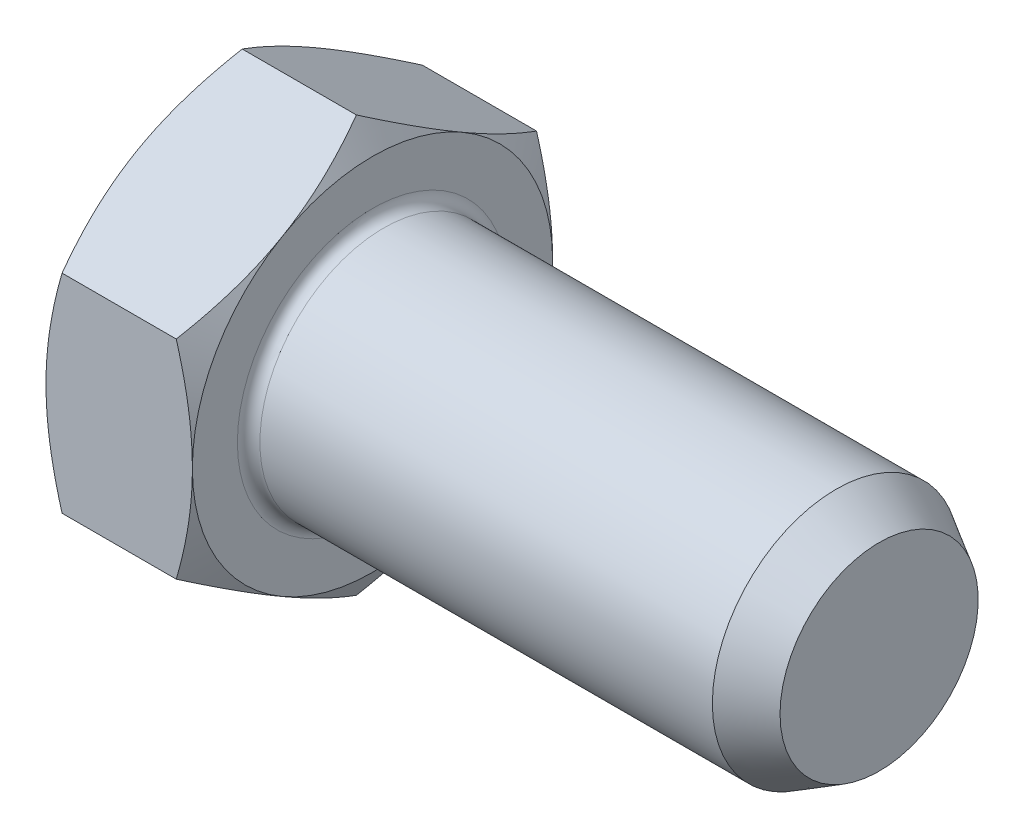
ISO-10303-21;
HEADER;
FILE_DESCRIPTION(('STEP AP214'),'2;1');
FILE_NAME('part.step','',(''),(''),'','','');
FILE_SCHEMA(('AUTOMOTIVE_DESIGN { 1 0 10303 214 1 1 1 1 }'));
ENDSEC;
DATA;
#1=APPLICATION_CONTEXT('core data for automotive mechanical design processes');
#2=APPLICATION_PROTOCOL_DEFINITION('international standard','automotive_design',2000,#1);
#3=PRODUCT_CONTEXT('',#1,'mechanical');
#4=PRODUCT('Part','Part','',(#3));
#5=PRODUCT_RELATED_PRODUCT_CATEGORY('part','',(#4));
#6=PRODUCT_DEFINITION_FORMATION('','',#4);
#7=PRODUCT_DEFINITION_CONTEXT('part definition',#1,'design');
#8=PRODUCT_DEFINITION('design','',#6,#7);
#9=PRODUCT_DEFINITION_SHAPE('','',#8);
#10=(LENGTH_UNIT() NAMED_UNIT(*) SI_UNIT(.MILLI.,.METRE.));
#11=(NAMED_UNIT(*) PLANE_ANGLE_UNIT() SI_UNIT($,.RADIAN.));
#12=(NAMED_UNIT(*) SI_UNIT($,.STERADIAN.) SOLID_ANGLE_UNIT());
#13=UNCERTAINTY_MEASURE_WITH_UNIT(LENGTH_MEASURE(1.E-05),#10,'distance_accuracy_value','');
#14=(GEOMETRIC_REPRESENTATION_CONTEXT(3) GLOBAL_UNCERTAINTY_ASSIGNED_CONTEXT((#13)) GLOBAL_UNIT_ASSIGNED_CONTEXT((#10,
#11,#12)) REPRESENTATION_CONTEXT('',''));
#15=CARTESIAN_POINT('',(0.,0.,0.));
#16=DIRECTION('',(0.,0.,1.));
#17=DIRECTION('',(1.,0.,0.));
#18=AXIS2_PLACEMENT_3D('',#15,#16,#17);
#19=CARTESIAN_POINT('',(0.,0.,0.));
#20=DIRECTION('',(-1.,0.,0.));
#21=DIRECTION('',(0.,0.,1.));
#22=AXIS2_PLACEMENT_3D('',#19,#20,#21);
#23=PLANE('',#22);
#24=CARTESIAN_POINT('',(0.,0.,0.));
#25=DIRECTION('',(-1.,0.,0.));
#26=DIRECTION('',(0.,0.,1.));
#27=AXIS2_PLACEMENT_3D('',#24,#25,#26);
#28=CIRCLE('',#27,1.6);
#29=CARTESIAN_POINT('',(0.,0.,1.6));
#30=VERTEX_POINT('',#29);
#31=CARTESIAN_POINT('',(0.,-1.3856406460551,0.799999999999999));
#32=VERTEX_POINT('',#31);
#33=EDGE_CURVE('E166',#30,#32,#28,.F.);
#34=ORIENTED_EDGE('',*,*,#33,.F.);
#35=CARTESIAN_POINT('',(0.,1.3856406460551,0.8));
#36=VERTEX_POINT('',#35);
#37=EDGE_CURVE('E131',#36,#30,#28,.F.);
#38=ORIENTED_EDGE('',*,*,#37,.F.);
#39=CARTESIAN_POINT('',(0.,1.3856406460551,-0.799999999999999));
#40=VERTEX_POINT('',#39);
#41=EDGE_CURVE('E164',#40,#36,#28,.F.);
#42=ORIENTED_EDGE('',*,*,#41,.F.);
#43=CARTESIAN_POINT('',(0.,0.,-1.6));
#44=VERTEX_POINT('',#43);
#45=EDGE_CURVE('E298',#44,#40,#28,.F.);
#46=ORIENTED_EDGE('',*,*,#45,.F.);
#47=CARTESIAN_POINT('',(0.,-1.3856406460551,-0.8));
#48=VERTEX_POINT('',#47);
#49=EDGE_CURVE('E302',#48,#44,#28,.F.);
#50=ORIENTED_EDGE('',*,*,#49,.F.);
#51=EDGE_CURVE('E309',#32,#48,#28,.F.);
#52=ORIENTED_EDGE('',*,*,#51,.F.);
#53=EDGE_LOOP('',(#34,#38,#42,#46,#50,#52));
#54=FACE_BOUND('',#53,.T.);
#55=CARTESIAN_POINT('',(0.,0.,0.));
#56=DIRECTION('',(-1.,0.,0.));
#57=DIRECTION('',(0.,0.,1.));
#58=AXIS2_PLACEMENT_3D('',#55,#56,#57);
#59=CIRCLE('',#58,1.28);
#60=CARTESIAN_POINT('',(0.,0.,1.28));
#61=VERTEX_POINT('',#60);
#62=EDGE_CURVE('E175',#61,#61,#59,.F.);
#63=ORIENTED_EDGE('',*,*,#62,.T.);
#64=EDGE_LOOP('',(#63));
#65=FACE_BOUND('',#64,.T.);
#66=ADVANCED_FACE('F35',(#54,#65),#23,.T.);
#67=CARTESIAN_POINT('',(1.3,1.4,0.));
#68=DIRECTION('',(1.,0.,0.));
#69=DIRECTION('',(0.,0.,-1.));
#70=AXIS2_PLACEMENT_3D('',#67,#68,#69);
#71=PLANE('',#70);
#72=CARTESIAN_POINT('',(1.3,0.,0.));
#73=DIRECTION('',(1.,0.,0.));
#74=DIRECTION('',(0.,0.,-1.));
#75=AXIS2_PLACEMENT_3D('',#72,#73,#74);
#76=CIRCLE('',#75,1.2);
#77=CARTESIAN_POINT('',(1.3,0.,-1.2));
#78=VERTEX_POINT('',#77);
#79=EDGE_CURVE('E11',#78,#78,#76,.F.);
#80=ORIENTED_EDGE('',*,*,#79,.T.);
#81=EDGE_LOOP('',(#80));
#82=FACE_BOUND('',#81,.T.);
#83=CARTESIAN_POINT('',(1.3,0.,0.));
#84=DIRECTION('',(1.,0.,0.));
#85=DIRECTION('',(0.,0.,-1.));
#86=AXIS2_PLACEMENT_3D('',#83,#84,#85);
#87=CIRCLE('',#86,1.6);
#88=CARTESIAN_POINT('',(1.3,-1.3856406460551,-0.8));
#89=VERTEX_POINT('',#88);
#90=CARTESIAN_POINT('',(1.3,0.,-1.6));
#91=VERTEX_POINT('',#90);
#92=EDGE_CURVE('E50',#89,#91,#87,.T.);
#93=ORIENTED_EDGE('',*,*,#92,.T.);
#94=CARTESIAN_POINT('',(1.3,1.3856406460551,-0.799999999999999));
#95=VERTEX_POINT('',#94);
#96=EDGE_CURVE('E58',#91,#95,#87,.T.);
#97=ORIENTED_EDGE('',*,*,#96,.T.);
#98=CARTESIAN_POINT('',(1.3,1.3856406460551,0.800000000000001));
#99=VERTEX_POINT('',#98);
#100=EDGE_CURVE('E344',#95,#99,#87,.T.);
#101=ORIENTED_EDGE('',*,*,#100,.T.);
#102=CARTESIAN_POINT('',(1.3,0.,1.6));
#103=VERTEX_POINT('',#102);
#104=EDGE_CURVE('E342',#99,#103,#87,.T.);
#105=ORIENTED_EDGE('',*,*,#104,.T.);
#106=CARTESIAN_POINT('',(1.3,-1.3856406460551,0.799999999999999));
#107=VERTEX_POINT('',#106);
#108=EDGE_CURVE('E339',#103,#107,#87,.T.);
#109=ORIENTED_EDGE('',*,*,#108,.T.);
#110=EDGE_CURVE('E332',#107,#89,#87,.T.);
#111=ORIENTED_EDGE('',*,*,#110,.T.);
#112=EDGE_LOOP('',(#93,#97,#101,#105,#109,#111));
#113=FACE_BOUND('',#112,.T.);
#114=ADVANCED_FACE('F340',(#82,#113),#71,.T.);
#115=CARTESIAN_POINT('',(13.1078858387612,0.,0.));
#116=DIRECTION('',(1.,0.,0.));
#117=DIRECTION('',(0.,0.,-1.));
#118=AXIS2_PLACEMENT_3D('',#115,#116,#117);
#119=CYLINDRICAL_SURFACE('',#118,1.1);
#120=CARTESIAN_POINT('',(1.4,0.,0.));
#121=DIRECTION('',(1.,0.,0.));
#122=DIRECTION('',(0.,0.,-1.));
#123=AXIS2_PLACEMENT_3D('',#120,#121,#122);
#124=CIRCLE('',#123,1.1);
#125=CARTESIAN_POINT('',(1.4,0.,-1.1));
#126=VERTEX_POINT('',#125);
#127=EDGE_CURVE('E43',#126,#126,#124,.T.);
#128=ORIENTED_EDGE('',*,*,#127,.T.);
#129=EDGE_LOOP('',(#128));
#130=FACE_BOUND('',#129,.T.);
#131=CARTESIAN_POINT('',(5.41894882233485,0.,0.));
#132=DIRECTION('',(1.,0.,0.));
#133=DIRECTION('',(0.,0.,-1.));
#134=AXIS2_PLACEMENT_3D('',#131,#132,#133);
#135=CIRCLE('',#134,1.1);
#136=CARTESIAN_POINT('',(5.41894882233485,0.,1.1));
#137=VERTEX_POINT('',#136);
#138=EDGE_CURVE('E354',#137,#137,#135,.F.);
#139=ORIENTED_EDGE('',*,*,#138,.T.);
#140=EDGE_LOOP('',(#139));
#141=FACE_BOUND('',#140,.T.);
#142=ADVANCED_FACE('F362',(#130,#141),#119,.T.);
#143=CARTESIAN_POINT('',(5.8,1.1,0.));
#144=DIRECTION('',(1.,0.,0.));
#145=DIRECTION('',(0.,0.,-1.));
#146=AXIS2_PLACEMENT_3D('',#143,#144,#145);
#147=PLANE('',#146);
#148=CARTESIAN_POINT('',(5.8,0.,0.));
#149=DIRECTION('',(1.,0.,0.));
#150=DIRECTION('',(0.,0.,-1.));
#151=AXIS2_PLACEMENT_3D('',#148,#149,#150);
#152=CIRCLE('',#151,0.879999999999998);
#153=CARTESIAN_POINT('',(5.8,0.,0.879999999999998));
#154=VERTEX_POINT('',#153);
#155=EDGE_CURVE('E352',#154,#154,#152,.T.);
#156=ORIENTED_EDGE('',*,*,#155,.T.);
#157=EDGE_LOOP('',(#156));
#158=FACE_BOUND('',#157,.T.);
#159=ADVANCED_FACE('F383',(#158),#147,.T.);
#160=CARTESIAN_POINT('',(0.65,0.,0.));
#161=DIRECTION('',(-1.,0.,0.));
#162=DIRECTION('',(0.,0.,1.));
#163=AXIS2_PLACEMENT_3D('',#160,#161,#162);
#164=CONICAL_SURFACE('',#163,2.72583302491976,1.04719755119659);
#165=CARTESIAN_POINT('',(1.15702709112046,-0.923644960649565,1.6002));
#166=CARTESIAN_POINT('',(1.18047613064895,-0.964240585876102,1.52988631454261));
#167=CARTESIAN_POINT('',(1.20180264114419,-1.00518662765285,1.45896568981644));
#168=CARTESIAN_POINT('',(1.23902934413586,-1.08778782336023,1.31589622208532));
#169=CARTESIAN_POINT('',(1.25491636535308,-1.12944444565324,1.24374483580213));
#170=CARTESIAN_POINT('',(1.27964828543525,-1.21224140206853,1.10033630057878));
#171=CARTESIAN_POINT('',(1.28865776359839,-1.25336899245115,1.02910122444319));
#172=CARTESIAN_POINT('',(1.299415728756,-1.33581782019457,0.886295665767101));
#173=CARTESIAN_POINT('',(1.30117312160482,-1.37713875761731,0.814725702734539));
#174=CARTESIAN_POINT('',(1.29752882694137,-1.45435771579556,0.680978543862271));
#175=CARTESIAN_POINT('',(1.29302194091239,-1.49026726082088,0.618781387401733));
#176=CARTESIAN_POINT('',(1.27873412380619,-1.5618523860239,0.494792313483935));
#177=CARTESIAN_POINT('',(1.26894830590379,-1.59752771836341,0.433000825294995));
#178=CARTESIAN_POINT('',(1.24448308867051,-1.66926059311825,0.30875584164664));
#179=CARTESIAN_POINT('',(1.22969992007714,-1.70530905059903,0.246318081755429));
#180=CARTESIAN_POINT('',(1.19614739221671,-1.77686812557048,0.122374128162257));
#181=CARTESIAN_POINT('',(1.17738592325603,-1.81237966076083,0.0608663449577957));
#182=CARTESIAN_POINT('',(1.15702709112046,-1.84763633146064,-0.000199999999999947));
#183=B_SPLINE_CURVE_WITH_KNOTS('',3,(#165,#166,#167,#168,#169,#170,#171,#172,#173,#174,#175,
#176,#177,#178,#179,#180,#181,#182),.UNSPECIFIED.,.F.,.F.,(4,2,2,2,2,2,2,2,4),(0.,
0.253628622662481,0.507867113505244,0.755812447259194,1.0034532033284,1.21912891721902,
1.43500463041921,1.65567058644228,1.87590291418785),.UNSPECIFIED.);
#184=CARTESIAN_POINT('',(1.15709376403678,-0.923760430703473,1.6));
#185=VERTEX_POINT('',#184);
#186=EDGE_CURVE('E159',#185,#107,#183,.T.);
#187=ORIENTED_EDGE('',*,*,#186,.T.);
#188=ORIENTED_EDGE('',*,*,#108,.F.);
#189=CARTESIAN_POINT('',(0.499873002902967,-2.52098464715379,1.6));
#190=CARTESIAN_POINT('',(0.534095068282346,-2.45076148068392,1.6));
#191=CARTESIAN_POINT('',(0.568000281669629,-2.38038131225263,1.6));
#192=CARTESIAN_POINT('',(0.634999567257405,-2.23922362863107,1.6));
#193=CARTESIAN_POINT('',(0.668093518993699,-2.16844605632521,1.6));
#194=CARTESIAN_POINT('',(0.733450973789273,-2.02606417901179,1.6));
#195=CARTESIAN_POINT('',(0.765709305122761,-1.95445749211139,1.6));
#196=CARTESIAN_POINT('',(0.828957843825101,-1.8106883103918,1.6));
#197=CARTESIAN_POINT('',(0.859948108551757,-1.73852584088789,1.6));
#198=CARTESIAN_POINT('',(0.921362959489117,-1.59104276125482,1.6));
#199=CARTESIAN_POINT('',(0.951731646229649,-1.51569874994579,1.6));
#200=CARTESIAN_POINT('',(1.01025914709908,-1.36415873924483,1.6));
#201=CARTESIAN_POINT('',(1.03841815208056,-1.28796281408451,1.6));
#202=CARTESIAN_POINT('',(1.09182525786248,-1.13470603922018,1.6));
#203=CARTESIAN_POINT('',(1.11707865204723,-1.05764705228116,1.6));
#204=CARTESIAN_POINT('',(1.16388736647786,-0.90242428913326,1.6));
#205=CARTESIAN_POINT('',(1.18544381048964,-0.824260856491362,1.6));
#206=CARTESIAN_POINT('',(1.22373292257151,-0.667228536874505,1.6));
#207=CARTESIAN_POINT('',(1.24049328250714,-0.588366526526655,1.6));
#208=CARTESIAN_POINT('',(1.26827361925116,-0.429622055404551,1.6));
#209=CARTESIAN_POINT('',(1.27929420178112,-0.349739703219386,1.6));
#210=CARTESIAN_POINT('',(1.2945707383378,-0.190409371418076,1.6));
#211=CARTESIAN_POINT('',(1.29891670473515,-0.110970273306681,1.6));
#212=CARTESIAN_POINT('',(1.30072544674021,0.0479847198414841,1.6));
#213=CARTESIAN_POINT('',(1.29818818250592,0.127500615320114,1.6));
#214=CARTESIAN_POINT('',(1.28423345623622,0.315948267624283,1.6));
#215=CARTESIAN_POINT('',(1.2698270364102,0.42466064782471,1.6));
#216=CARTESIAN_POINT('',(1.23056818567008,0.640184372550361,1.6));
#217=CARTESIAN_POINT('',(1.20570615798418,0.746993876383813,1.6));
#218=CARTESIAN_POINT('',(1.14763012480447,0.960879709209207,1.6));
#219=CARTESIAN_POINT('',(1.11423830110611,1.06790639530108,1.6));
#220=CARTESIAN_POINT('',(1.04181251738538,1.2799660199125,1.6));
#221=CARTESIAN_POINT('',(1.0027798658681,1.38499941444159,1.6));
#222=CARTESIAN_POINT('',(0.930792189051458,1.56799469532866,1.6));
#223=CARTESIAN_POINT('',(0.898685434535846,1.64629502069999,1.6));
#224=CARTESIAN_POINT('',(0.832721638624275,1.80215714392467,1.6));
#225=CARTESIAN_POINT('',(0.798864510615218,1.8797189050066,1.6));
#226=CARTESIAN_POINT('',(0.695256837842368,2.11154275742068,1.6));
#227=CARTESIAN_POINT('',(0.623487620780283,2.26490000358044,1.6));
#228=CARTESIAN_POINT('',(0.476501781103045,2.57016984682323,1.6));
#229=CARTESIAN_POINT('',(0.401280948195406,2.72208039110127,1.6));
#230=CARTESIAN_POINT('',(0.248594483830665,3.02477374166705,1.6));
#231=CARTESIAN_POINT('',(0.171128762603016,3.17555650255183,1.6));
#232=CARTESIAN_POINT('',(0.021984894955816,3.46221292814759,1.6));
#233=CARTESIAN_POINT('',(-0.0495548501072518,3.59815887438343,1.6));
#234=CARTESIAN_POINT('',(-0.1935806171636,3.86955633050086,1.6));
#235=CARTESIAN_POINT('',(-0.266066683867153,4.00500781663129,1.6));
#236=CARTESIAN_POINT('',(-0.411533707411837,4.27512524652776,1.6));
#237=CARTESIAN_POINT('',(-0.484512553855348,4.40979232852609,1.6));
#238=CARTESIAN_POINT('',(-0.631022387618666,4.67881425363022,1.6));
#239=CARTESIAN_POINT('',(-0.704553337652,4.81316911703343,1.6));
#240=CARTESIAN_POINT('',(-0.778287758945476,4.94741144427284,1.6));
#241=B_SPLINE_CURVE_WITH_KNOTS('',3,(#189,#190,#191,#192,#193,#194,#195,#196,#197,#198,#199,
#200,#201,#202,#203,#204,#205,#206,#207,#208,#209,#210,#211,#212,#213,#214,#215,#216,#217,#218,
#219,#220,#221,#222,#223,#224,#225,#226,#227,#228,#229,#230,#231,#232,#233,#234,#235,#236,#237,
#238,#239,#240),.UNSPECIFIED.,.F.,.F.,(4,2,2,2,2,2,2,2,2,2,2,2,2,2,2,2,2,2,2,2,2,2,2,2,2,4),(0.,
0.234357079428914,0.468748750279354,0.704350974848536,0.939942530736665,1.18361811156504,
1.42727262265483,1.67047597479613,1.91360526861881,2.15530105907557,2.39697133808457,
2.63535296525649,2.87373597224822,3.20204898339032,3.53066399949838,3.86678588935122,
4.2028299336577,4.45668877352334,4.71056018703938,5.21844347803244,5.72696367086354,
6.23550422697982,6.69636122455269,7.15724007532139,7.61674952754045,8.0762282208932),.UNSPECIFIED.);
#242=EDGE_CURVE('E167',#103,#185,#241,.F.);
#243=ORIENTED_EDGE('',*,*,#242,.T.);
#244=EDGE_LOOP('',(#187,#188,#243));
#245=FACE_BOUND('',#244,.T.);
#246=ADVANCED_FACE('F385',(#245),#164,.T.);
#247=CARTESIAN_POINT('',(1.15702709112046,1.84763633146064,-0.0001999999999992));
#248=CARTESIAN_POINT('',(1.18047613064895,1.8070407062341,0.0701136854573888));
#249=CARTESIAN_POINT('',(1.20180264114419,1.76609466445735,0.14103431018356));
#250=CARTESIAN_POINT('',(1.23902934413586,1.68349346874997,0.284103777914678));
#251=CARTESIAN_POINT('',(1.25491636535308,1.64183684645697,0.356255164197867));
#252=CARTESIAN_POINT('',(1.27964828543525,1.55903989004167,0.499663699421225));
#253=CARTESIAN_POINT('',(1.28865776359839,1.51791229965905,0.570898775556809));
#254=CARTESIAN_POINT('',(1.299415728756,1.43546347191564,0.713704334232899));
#255=CARTESIAN_POINT('',(1.30117312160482,1.39414253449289,0.785274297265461));
#256=CARTESIAN_POINT('',(1.29752882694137,1.31692357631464,0.919021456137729));
#257=CARTESIAN_POINT('',(1.29302194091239,1.28101403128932,0.981218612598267));
#258=CARTESIAN_POINT('',(1.27873412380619,1.20942890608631,1.10520768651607));
#259=CARTESIAN_POINT('',(1.26894830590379,1.1737535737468,1.16699917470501));
#260=CARTESIAN_POINT('',(1.24448308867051,1.10202069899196,1.29124415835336));
#261=CARTESIAN_POINT('',(1.22969992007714,1.06597224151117,1.35368191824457));
#262=CARTESIAN_POINT('',(1.19614739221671,0.994413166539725,1.47762587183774));
#263=CARTESIAN_POINT('',(1.17738592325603,0.958901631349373,1.5391336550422));
#264=CARTESIAN_POINT('',(1.15702709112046,0.923644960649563,1.6002));
#265=B_SPLINE_CURVE_WITH_KNOTS('',3,(#247,#248,#249,#250,#251,#252,#253,#254,#255,#256,#257,
#258,#259,#260,#261,#262,#263,#264),.UNSPECIFIED.,.F.,.F.,(4,2,2,2,2,2,2,2,4),(0.,
0.253628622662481,0.507867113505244,0.755812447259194,1.0034532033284,1.21912891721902,
1.43500463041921,1.65567058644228,1.87590291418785),.UNSPECIFIED.);
#266=CARTESIAN_POINT('',(1.15709376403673,0.923760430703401,1.6));
#267=VERTEX_POINT('',#266);
#268=EDGE_CURVE('E317',#99,#267,#265,.T.);
#269=ORIENTED_EDGE('',*,*,#268,.T.);
#270=EDGE_CURVE('E152',#267,#103,#241,.F.);
#271=ORIENTED_EDGE('',*,*,#270,.T.);
#272=ORIENTED_EDGE('',*,*,#104,.F.);
#273=EDGE_LOOP('',(#269,#271,#272));
#274=FACE_BOUND('',#273,.T.);
#275=ADVANCED_FACE('F177',(#274),#164,.T.);
#276=CARTESIAN_POINT('',(1.15702709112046,0.923644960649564,-1.6002));
#277=CARTESIAN_POINT('',(1.18047613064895,0.964240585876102,-1.52988631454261));
#278=CARTESIAN_POINT('',(1.20180264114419,1.00518662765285,-1.45896568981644));
#279=CARTESIAN_POINT('',(1.23902934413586,1.08778782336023,-1.31589622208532));
#280=CARTESIAN_POINT('',(1.25491636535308,1.12944444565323,-1.24374483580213));
#281=CARTESIAN_POINT('',(1.27964828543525,1.21224140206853,-1.10033630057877));
#282=CARTESIAN_POINT('',(1.28865776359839,1.25336899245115,-1.02910122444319));
#283=CARTESIAN_POINT('',(1.299415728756,1.33581782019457,-0.886295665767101));
#284=CARTESIAN_POINT('',(1.30117312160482,1.37713875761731,-0.814725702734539));
#285=CARTESIAN_POINT('',(1.29752882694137,1.45435771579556,-0.680978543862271));
#286=CARTESIAN_POINT('',(1.29302194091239,1.49026726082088,-0.618781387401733));
#287=CARTESIAN_POINT('',(1.27873412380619,1.5618523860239,-0.494792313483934));
#288=CARTESIAN_POINT('',(1.26894830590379,1.59752771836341,-0.433000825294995));
#289=CARTESIAN_POINT('',(1.24448308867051,1.66926059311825,-0.30875584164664));
#290=CARTESIAN_POINT('',(1.22969992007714,1.70530905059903,-0.246318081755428));
#291=CARTESIAN_POINT('',(1.19614739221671,1.77686812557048,-0.122374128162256));
#292=CARTESIAN_POINT('',(1.17738592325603,1.81237966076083,-0.0608663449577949));
#293=CARTESIAN_POINT('',(1.15702709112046,1.84763633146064,0.000200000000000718));
#294=B_SPLINE_CURVE_WITH_KNOTS('',3,(#276,#277,#278,#279,#280,#281,#282,#283,#284,#285,#286,
#287,#288,#289,#290,#291,#292,#293),.UNSPECIFIED.,.F.,.F.,(4,2,2,2,2,2,2,2,4),(0.,
0.253628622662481,0.507867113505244,0.755812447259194,1.0034532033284,1.21912891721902,
1.43500463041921,1.65567058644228,1.87590291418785),.UNSPECIFIED.);
#295=CARTESIAN_POINT('',(1.15709376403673,1.8475208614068,0.));
#296=VERTEX_POINT('',#295);
#297=EDGE_CURVE('E261',#95,#296,#294,.T.);
#298=ORIENTED_EDGE('',*,*,#297,.T.);
#299=EDGE_CURVE('E321',#296,#99,#265,.T.);
#300=ORIENTED_EDGE('',*,*,#299,.T.);
#301=ORIENTED_EDGE('',*,*,#100,.F.);
#302=EDGE_LOOP('',(#298,#300,#301));
#303=FACE_BOUND('',#302,.T.);
#304=ADVANCED_FACE('F350',(#303),#164,.T.);
#305=CARTESIAN_POINT('',(0.499873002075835,-2.5209846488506,-1.6));
#306=CARTESIAN_POINT('',(0.53409506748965,-2.45076148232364,-1.6));
#307=CARTESIAN_POINT('',(0.568000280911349,-2.38038131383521,-1.6));
#308=CARTESIAN_POINT('',(0.634999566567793,-2.23922363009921,-1.6));
#309=CARTESIAN_POINT('',(0.668093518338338,-2.16844605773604,-1.6));
#310=CARTESIAN_POINT('',(0.733450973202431,-2.02606418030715,-1.6));
#311=CARTESIAN_POINT('',(0.765709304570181,-1.95445749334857,-1.6));
#312=CARTESIAN_POINT('',(0.828957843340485,-1.81068831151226,-1.6));
#313=CARTESIAN_POINT('',(0.859948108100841,-1.73852584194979,-1.6));
#314=CARTESIAN_POINT('',(0.921362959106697,-1.59104276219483,-1.6));
#315=CARTESIAN_POINT('',(0.951731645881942,-1.51569875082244,-1.6));
#316=CARTESIAN_POINT('',(1.01025914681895,-1.36415873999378,-1.6));
#317=CARTESIAN_POINT('',(1.0384181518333,-1.28796281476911,-1.6));
#318=CARTESIAN_POINT('',(1.09182525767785,-1.1347060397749,-1.6));
#319=CARTESIAN_POINT('',(1.11707865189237,-1.05764705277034,-1.6));
#320=CARTESIAN_POINT('',(1.16388736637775,-0.902424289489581,-1.6));
#321=CARTESIAN_POINT('',(1.1854438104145,-0.824260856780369,-1.6));
#322=CARTESIAN_POINT('',(1.22373292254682,-0.667228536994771,-1.6));
#323=CARTESIAN_POINT('',(1.24049328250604,-0.588366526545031,-1.6));
#324=CARTESIAN_POINT('',(1.26827361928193,-0.429622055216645,-1.6));
#325=CARTESIAN_POINT('',(1.27929420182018,-0.349739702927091,-1.6));
#326=CARTESIAN_POINT('',(1.29457073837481,-0.190409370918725,-1.6));
#327=CARTESIAN_POINT('',(1.29891670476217,-0.110970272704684,-1.6));
#328=CARTESIAN_POINT('',(1.30072544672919,0.0479847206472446,-1.6));
#329=CARTESIAN_POINT('',(1.29818818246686,0.127500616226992,-1.6));
#330=CARTESIAN_POINT('',(1.28423345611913,0.315948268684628,-1.6));
#331=CARTESIAN_POINT('',(1.26982703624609,0.424660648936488,-1.6));
#332=CARTESIAN_POINT('',(1.23056818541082,0.640184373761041,-1.6));
#333=CARTESIAN_POINT('',(1.20570615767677,0.746993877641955,-1.6));
#334=CARTESIAN_POINT('',(1.14763012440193,0.960879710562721,-1.6));
#335=CARTESIAN_POINT('',(1.11423830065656,1.06790639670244,-1.6));
#336=CARTESIAN_POINT('',(1.0418125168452,1.27996602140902,-1.6));
#337=CARTESIAN_POINT('',(1.0027798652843,1.38499941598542,-1.6));
#338=CARTESIAN_POINT('',(0.930792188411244,1.56799469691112,-1.6));
#339=CARTESIAN_POINT('',(0.898685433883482,1.64629502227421,-1.6));
#340=CARTESIAN_POINT('',(0.832721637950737,1.80215714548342,-1.6));
#341=CARTESIAN_POINT('',(0.798864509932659,1.87971890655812,-1.6));
#342=CARTESIAN_POINT('',(0.695256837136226,2.11154275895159,-1.6));
#343=CARTESIAN_POINT('',(0.623487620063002,2.26490000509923,-1.6));
#344=CARTESIAN_POINT('',(0.476501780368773,2.57016984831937,-1.6));
#345=CARTESIAN_POINT('',(0.401280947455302,2.7220803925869,-1.6));
#346=CARTESIAN_POINT('',(0.248594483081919,3.02477374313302,-1.6));
#347=CARTESIAN_POINT('',(0.171128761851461,3.17555650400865,-1.6));
#348=CARTESIAN_POINT('',(0.0219848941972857,3.46221292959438,-1.6));
#349=CARTESIAN_POINT('',(-0.0495548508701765,3.59815887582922,-1.6));
#350=CARTESIAN_POINT('',(-0.193580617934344,3.86955633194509,-1.6));
#351=CARTESIAN_POINT('',(-0.266066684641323,4.00500781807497,-1.6));
#352=CARTESIAN_POINT('',(-0.411533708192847,4.2751252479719,-1.6));
#353=CARTESIAN_POINT('',(-0.48451255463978,4.40979232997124,-1.6));
#354=CARTESIAN_POINT('',(-0.631022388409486,4.67881425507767,-1.6));
#355=CARTESIAN_POINT('',(-0.704553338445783,4.81316911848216,-1.6));
#356=CARTESIAN_POINT('',(-0.778287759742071,4.94741144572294,-1.6));
#357=B_SPLINE_CURVE_WITH_KNOTS('',3,(#305,#306,#307,#308,#309,#310,#311,#312,#313,#314,#315,
#316,#317,#318,#319,#320,#321,#322,#323,#324,#325,#326,#327,#328,#329,#330,#331,#332,#333,#334,
#335,#336,#337,#338,#339,#340,#341,#342,#343,#344,#345,#346,#347,#348,#349,#350,#351,#352,#353,
#354,#355,#356),.UNSPECIFIED.,.F.,.F.,(4,2,2,2,2,2,2,2,2,2,2,2,2,2,2,2,2,2,2,2,2,2,2,2,2,4),(0.,
0.234357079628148,0.468748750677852,0.704350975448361,0.939942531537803,1.1836181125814,
1.42727262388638,1.67047597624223,1.9136052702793,2.1553010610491,2.3969713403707,
2.63535296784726,2.87373597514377,3.20204898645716,3.53066400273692,3.86678589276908,
4.20282993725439,4.45668877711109,4.71056019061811,5.21844348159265,5.7269636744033,
6.23550423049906,6.69636122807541,7.15724007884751,7.61674953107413,8.07622822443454),.UNSPECIFIED.);
#358=CARTESIAN_POINT('',(1.15709376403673,0.923760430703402,-1.6));
#359=VERTEX_POINT('',#358);
#360=EDGE_CURVE('E252',#91,#359,#357,.T.);
#361=ORIENTED_EDGE('',*,*,#360,.T.);
#362=EDGE_CURVE('E260',#359,#95,#294,.T.);
#363=ORIENTED_EDGE('',*,*,#362,.T.);
#364=ORIENTED_EDGE('',*,*,#96,.F.);
#365=EDGE_LOOP('',(#361,#363,#364));
#366=FACE_BOUND('',#365,.T.);
#367=ADVANCED_FACE('F397',(#366),#164,.T.);
#368=CARTESIAN_POINT('',(1.15702709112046,-1.84763633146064,0.0002));
#369=CARTESIAN_POINT('',(1.18047613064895,-1.8070407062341,-0.0701136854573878));
#370=CARTESIAN_POINT('',(1.20180264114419,-1.76609466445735,-0.141034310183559));
#371=CARTESIAN_POINT('',(1.23902934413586,-1.68349346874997,-0.284103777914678));
#372=CARTESIAN_POINT('',(1.25491636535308,-1.64183684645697,-0.356255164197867));
#373=CARTESIAN_POINT('',(1.27964828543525,-1.55903989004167,-0.499663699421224));
#374=CARTESIAN_POINT('',(1.28865776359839,-1.51791229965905,-0.570898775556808));
#375=CARTESIAN_POINT('',(1.299415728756,-1.43546347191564,-0.713704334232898));
#376=CARTESIAN_POINT('',(1.30117312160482,-1.39414253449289,-0.78527429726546));
#377=CARTESIAN_POINT('',(1.29752882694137,-1.31692357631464,-0.919021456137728));
#378=CARTESIAN_POINT('',(1.29302194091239,-1.28101403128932,-0.981218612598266));
#379=CARTESIAN_POINT('',(1.27873412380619,-1.20942890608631,-1.10520768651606));
#380=CARTESIAN_POINT('',(1.26894830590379,-1.1737535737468,-1.166999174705));
#381=CARTESIAN_POINT('',(1.24448308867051,-1.10202069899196,-1.29124415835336));
#382=CARTESIAN_POINT('',(1.22969992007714,-1.06597224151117,-1.35368191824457));
#383=CARTESIAN_POINT('',(1.19614739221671,-0.994413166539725,-1.47762587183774));
#384=CARTESIAN_POINT('',(1.17738592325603,-0.958901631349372,-1.5391336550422));
#385=CARTESIAN_POINT('',(1.15702709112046,-0.923644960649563,-1.6002));
#386=B_SPLINE_CURVE_WITH_KNOTS('',3,(#368,#369,#370,#371,#372,#373,#374,#375,#376,#377,#378,
#379,#380,#381,#382,#383,#384,#385),.UNSPECIFIED.,.F.,.F.,(4,2,2,2,2,2,2,2,4),(0.,
0.253628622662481,0.507867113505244,0.755812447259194,1.0034532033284,1.21912891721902,
1.43500463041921,1.65567058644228,1.87590291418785),.UNSPECIFIED.);
#387=CARTESIAN_POINT('',(1.15709376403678,-0.923760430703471,-1.6));
#388=VERTEX_POINT('',#387);
#389=EDGE_CURVE('E266',#89,#388,#386,.T.);
#390=ORIENTED_EDGE('',*,*,#389,.T.);
#391=EDGE_CURVE('E259',#388,#91,#357,.T.);
#392=ORIENTED_EDGE('',*,*,#391,.T.);
#393=ORIENTED_EDGE('',*,*,#92,.F.);
#394=EDGE_LOOP('',(#390,#392,#393));
#395=FACE_BOUND('',#394,.T.);
#396=ADVANCED_FACE('F393',(#395),#164,.T.);
#397=CARTESIAN_POINT('',(1.15709376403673,-1.8475208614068,0.));
#398=VERTEX_POINT('',#397);
#399=EDGE_CURVE('E273',#107,#398,#183,.T.);
#400=ORIENTED_EDGE('',*,*,#399,.T.);
#401=EDGE_CURVE('E272',#398,#89,#386,.T.);
#402=ORIENTED_EDGE('',*,*,#401,.T.);
#403=ORIENTED_EDGE('',*,*,#110,.F.);
#404=EDGE_LOOP('',(#400,#402,#403));
#405=FACE_BOUND('',#404,.T.);
#406=ADVANCED_FACE('F185',(#405),#164,.T.);
#407=CARTESIAN_POINT('',(1.3,-0.923760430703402,1.6));
#408=DIRECTION('',(0.,0.,1.));
#409=DIRECTION('',(0.,-1.,0.));
#410=AXIS2_PLACEMENT_3D('',#407,#408,#409);
#411=PLANE('',#410);
#412=ORIENTED_EDGE('',*,*,#270,.F.);
#413=DIRECTION('',(-1.,0.,0.));
#414=VECTOR('',#413,1.);
#415=CARTESIAN_POINT('',(1.3,0.923760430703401,1.6));
#416=LINE('',#415,#414);
#417=CARTESIAN_POINT('',(0.142906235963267,0.923760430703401,1.6));
#418=VERTEX_POINT('',#417);
#419=EDGE_CURVE('E144',#267,#418,#416,.T.);
#420=ORIENTED_EDGE('',*,*,#419,.T.);
#421=CARTESIAN_POINT('',(0.800126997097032,-2.52098464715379,1.6));
#422=CARTESIAN_POINT('',(0.765904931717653,-2.45076148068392,1.6));
#423=CARTESIAN_POINT('',(0.73199971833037,-2.38038131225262,1.6));
#424=CARTESIAN_POINT('',(0.665000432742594,-2.23922362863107,1.6));
#425=CARTESIAN_POINT('',(0.6319064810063,-2.16844605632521,1.6));
#426=CARTESIAN_POINT('',(0.566549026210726,-2.02606417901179,1.6));
#427=CARTESIAN_POINT('',(0.534290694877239,-1.95445749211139,1.6));
#428=CARTESIAN_POINT('',(0.471042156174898,-1.8106883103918,1.6));
#429=CARTESIAN_POINT('',(0.440051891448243,-1.73852584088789,1.6));
#430=CARTESIAN_POINT('',(0.378637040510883,-1.59104276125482,1.6));
#431=CARTESIAN_POINT('',(0.348268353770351,-1.51569874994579,1.6));
#432=CARTESIAN_POINT('',(0.289740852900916,-1.36415873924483,1.6));
#433=CARTESIAN_POINT('',(0.261581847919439,-1.28796281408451,1.6));
#434=CARTESIAN_POINT('',(0.208174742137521,-1.13470603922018,1.6));
#435=CARTESIAN_POINT('',(0.182921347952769,-1.05764705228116,1.6));
#436=CARTESIAN_POINT('',(0.136112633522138,-0.90242428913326,1.6));
#437=CARTESIAN_POINT('',(0.114556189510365,-0.824260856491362,1.6));
#438=CARTESIAN_POINT('',(0.0762670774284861,-0.667228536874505,1.6));
#439=CARTESIAN_POINT('',(0.0595067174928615,-0.588366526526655,1.6));
#440=CARTESIAN_POINT('',(0.0317263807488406,-0.42962205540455,1.6));
#441=CARTESIAN_POINT('',(0.0207057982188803,-0.349739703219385,1.6));
#442=CARTESIAN_POINT('',(0.00542926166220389,-0.190409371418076,1.6));
#443=CARTESIAN_POINT('',(0.00108329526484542,-0.11097027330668,1.6));
#444=CARTESIAN_POINT('',(-0.000725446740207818,0.0479847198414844,1.6));
#445=CARTESIAN_POINT('',(0.00181181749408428,0.127500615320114,1.6));
#446=CARTESIAN_POINT('',(0.0157665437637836,0.315948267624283,1.6));
#447=CARTESIAN_POINT('',(0.0301729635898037,0.42466064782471,1.6));
#448=CARTESIAN_POINT('',(0.0694318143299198,0.640184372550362,1.6));
#449=CARTESIAN_POINT('',(0.0942938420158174,0.746993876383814,1.6));
#450=CARTESIAN_POINT('',(0.152369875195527,0.960879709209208,1.6));
#451=CARTESIAN_POINT('',(0.185761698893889,1.06790639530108,1.6));
#452=CARTESIAN_POINT('',(0.258187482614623,1.2799660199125,1.6));
#453=CARTESIAN_POINT('',(0.297220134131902,1.38499941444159,1.6));
#454=CARTESIAN_POINT('',(0.369207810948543,1.56799469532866,1.6));
#455=CARTESIAN_POINT('',(0.401314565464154,1.64629502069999,1.6));
#456=CARTESIAN_POINT('',(0.467278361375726,1.80215714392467,1.6));
#457=CARTESIAN_POINT('',(0.501135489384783,1.8797189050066,1.6));
#458=CARTESIAN_POINT('',(0.604743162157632,2.11154275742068,1.6));
#459=CARTESIAN_POINT('',(0.676512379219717,2.26490000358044,1.6));
#460=CARTESIAN_POINT('',(0.823498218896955,2.57016984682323,1.6));
#461=CARTESIAN_POINT('',(0.898719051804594,2.72208039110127,1.6));
#462=CARTESIAN_POINT('',(1.05140551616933,3.02477374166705,1.6));
#463=CARTESIAN_POINT('',(1.12887123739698,3.17555650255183,1.6));
#464=CARTESIAN_POINT('',(1.27801510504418,3.4622129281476,1.6));
#465=CARTESIAN_POINT('',(1.34955485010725,3.59815887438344,1.6));
#466=CARTESIAN_POINT('',(1.4935806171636,3.86955633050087,1.6));
#467=CARTESIAN_POINT('',(1.56606668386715,4.0050078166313,1.6));
#468=CARTESIAN_POINT('',(1.71153370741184,4.27512524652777,1.6));
#469=CARTESIAN_POINT('',(1.78451255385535,4.40979232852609,1.6));
#470=CARTESIAN_POINT('',(1.93102238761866,4.67881425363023,1.6));
#471=CARTESIAN_POINT('',(2.004553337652,4.81316911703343,1.6));
#472=CARTESIAN_POINT('',(2.07828775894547,4.94741144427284,1.6));
#473=B_SPLINE_CURVE_WITH_KNOTS('',3,(#421,#422,#423,#424,#425,#426,#427,#428,#429,#430,#431,
#432,#433,#434,#435,#436,#437,#438,#439,#440,#441,#442,#443,#444,#445,#446,#447,#448,#449,#450,
#451,#452,#453,#454,#455,#456,#457,#458,#459,#460,#461,#462,#463,#464,#465,#466,#467,#468,#469,
#470,#471,#472),.UNSPECIFIED.,.F.,.F.,(4,2,2,2,2,2,2,2,2,2,2,2,2,2,2,2,2,2,2,2,2,2,2,2,2,4),(0.,
0.234357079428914,0.468748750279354,0.704350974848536,0.939942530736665,1.18361811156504,
1.42727262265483,1.67047597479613,1.91360526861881,2.15530105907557,2.39697133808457,
2.63535296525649,2.87373597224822,3.20204898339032,3.53066399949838,3.86678588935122,
4.2028299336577,4.45668877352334,4.71056018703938,5.21844347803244,5.72696367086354,
6.23550422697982,6.69636122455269,7.15724007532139,7.61674952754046,8.0762282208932),.UNSPECIFIED.);
#474=EDGE_CURVE('E126',#30,#418,#473,.T.);
#475=ORIENTED_EDGE('',*,*,#474,.F.);
#476=CARTESIAN_POINT('',(0.142906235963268,-0.923760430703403,1.6));
#477=VERTEX_POINT('',#476);
#478=EDGE_CURVE('E137',#477,#30,#473,.T.);
#479=ORIENTED_EDGE('',*,*,#478,.F.);
#480=DIRECTION('',(-1.,0.,0.));
#481=VECTOR('',#480,1.);
#482=CARTESIAN_POINT('',(1.3,-0.923760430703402,1.6));
#483=LINE('',#482,#481);
#484=EDGE_CURVE('E154',#185,#477,#483,.T.);
#485=ORIENTED_EDGE('',*,*,#484,.F.);
#486=ORIENTED_EDGE('',*,*,#242,.F.);
#487=EDGE_LOOP('',(#412,#420,#475,#479,#485,#486));
#488=FACE_BOUND('',#487,.T.);
#489=ADVANCED_FACE('F150',(#488),#411,.T.);
#490=CARTESIAN_POINT('',(1.3,0.923760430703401,1.6));
#491=DIRECTION('',(0.,0.866025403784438,0.5));
#492=DIRECTION('',(0.,-0.5,0.866025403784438));
#493=AXIS2_PLACEMENT_3D('',#490,#491,#492);
#494=PLANE('',#493);
#495=ORIENTED_EDGE('',*,*,#299,.F.);
#496=DIRECTION('',(-1.,0.,0.));
#497=VECTOR('',#496,1.);
#498=CARTESIAN_POINT('',(1.3,1.8475208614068,0.));
#499=LINE('',#498,#497);
#500=CARTESIAN_POINT('',(0.142906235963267,1.8475208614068,0.));
#501=VERTEX_POINT('',#500);
#502=EDGE_CURVE('E153',#296,#501,#499,.T.);
#503=ORIENTED_EDGE('',*,*,#502,.T.);
#504=CARTESIAN_POINT('',(0.142972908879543,0.923644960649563,1.6002));
#505=CARTESIAN_POINT('',(0.119523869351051,0.964240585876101,1.52988631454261));
#506=CARTESIAN_POINT('',(0.0981973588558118,1.00518662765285,1.45896568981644));
#507=CARTESIAN_POINT('',(0.0609706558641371,1.08778782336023,1.31589622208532));
#508=CARTESIAN_POINT('',(0.0450836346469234,1.12944444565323,1.24374483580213));
#509=CARTESIAN_POINT('',(0.0203517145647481,1.21224140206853,1.10033630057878));
#510=CARTESIAN_POINT('',(0.0113422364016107,1.25336899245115,1.02910122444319));
#511=CARTESIAN_POINT('',(0.000584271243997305,1.33581782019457,0.886295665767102));
#512=CARTESIAN_POINT('',(-0.00117312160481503,1.37713875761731,0.81472570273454));
#513=CARTESIAN_POINT('',(0.00247117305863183,1.45435771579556,0.680978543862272));
#514=CARTESIAN_POINT('',(0.00697805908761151,1.49026726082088,0.618781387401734));
#515=CARTESIAN_POINT('',(0.0212658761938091,1.56185238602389,0.494792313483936));
#516=CARTESIAN_POINT('',(0.0310516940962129,1.59752771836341,0.433000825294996));
#517=CARTESIAN_POINT('',(0.0555169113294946,1.66926059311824,0.308755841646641));
#518=CARTESIAN_POINT('',(0.0703000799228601,1.70530905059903,0.24631808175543));
#519=CARTESIAN_POINT('',(0.103852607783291,1.77686812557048,0.122374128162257));
#520=CARTESIAN_POINT('',(0.122614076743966,1.81237966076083,0.0608663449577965));
#521=CARTESIAN_POINT('',(0.142972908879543,1.84763633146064,-0.000199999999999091));
#522=B_SPLINE_CURVE_WITH_KNOTS('',3,(#504,#505,#506,#507,#508,#509,#510,#511,#512,#513,#514,
#515,#516,#517,#518,#519,#520,#521),.UNSPECIFIED.,.F.,.F.,(4,2,2,2,2,2,2,2,4),(0.,
0.253628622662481,0.507867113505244,0.755812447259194,1.0034532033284,1.21912891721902,
1.43500463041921,1.65567058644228,1.87590291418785),.UNSPECIFIED.);
#523=EDGE_CURVE('E146',#36,#501,#522,.T.);
#524=ORIENTED_EDGE('',*,*,#523,.F.);
#525=EDGE_CURVE('E129',#418,#36,#522,.T.);
#526=ORIENTED_EDGE('',*,*,#525,.F.);
#527=ORIENTED_EDGE('',*,*,#419,.F.);
#528=ORIENTED_EDGE('',*,*,#268,.F.);
#529=EDGE_LOOP('',(#495,#503,#524,#526,#527,#528));
#530=FACE_BOUND('',#529,.T.);
#531=ADVANCED_FACE('F142',(#530),#494,.T.);
#532=CARTESIAN_POINT('',(1.3,1.8475208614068,0.));
#533=DIRECTION('',(0.,0.866025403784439,-0.5));
#534=DIRECTION('',(0.,0.5,0.866025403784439));
#535=AXIS2_PLACEMENT_3D('',#532,#533,#534);
#536=PLANE('',#535);
#537=ORIENTED_EDGE('',*,*,#362,.F.);
#538=DIRECTION('',(-1.,0.,0.));
#539=VECTOR('',#538,1.);
#540=CARTESIAN_POINT('',(1.3,0.923760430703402,-1.6));
#541=LINE('',#540,#539);
#542=CARTESIAN_POINT('',(0.142906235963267,0.923760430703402,-1.6));
#543=VERTEX_POINT('',#542);
#544=EDGE_CURVE('E156',#359,#543,#541,.T.);
#545=ORIENTED_EDGE('',*,*,#544,.T.);
#546=CARTESIAN_POINT('',(0.142972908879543,1.84763633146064,0.000200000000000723));
#547=CARTESIAN_POINT('',(0.119523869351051,1.8070407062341,-0.0701136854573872));
#548=CARTESIAN_POINT('',(0.0981973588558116,1.76609466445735,-0.141034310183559));
#549=CARTESIAN_POINT('',(0.0609706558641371,1.68349346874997,-0.284103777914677));
#550=CARTESIAN_POINT('',(0.0450836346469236,1.64183684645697,-0.356255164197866));
#551=CARTESIAN_POINT('',(0.0203517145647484,1.55903989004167,-0.499663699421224));
#552=CARTESIAN_POINT('',(0.0113422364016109,1.51791229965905,-0.570898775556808));
#553=CARTESIAN_POINT('',(0.000584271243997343,1.43546347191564,-0.713704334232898));
#554=CARTESIAN_POINT('',(-0.001173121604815,1.3941425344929,-0.78527429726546));
#555=CARTESIAN_POINT('',(0.00247117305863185,1.31692357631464,-0.919021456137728));
#556=CARTESIAN_POINT('',(0.00697805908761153,1.28101403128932,-0.981218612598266));
#557=CARTESIAN_POINT('',(0.0212658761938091,1.20942890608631,-1.10520768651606));
#558=CARTESIAN_POINT('',(0.0310516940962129,1.1737535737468,-1.166999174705));
#559=CARTESIAN_POINT('',(0.0555169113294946,1.10202069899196,-1.29124415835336));
#560=CARTESIAN_POINT('',(0.0703000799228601,1.06597224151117,-1.35368191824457));
#561=CARTESIAN_POINT('',(0.103852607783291,0.994413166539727,-1.47762587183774));
#562=CARTESIAN_POINT('',(0.122614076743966,0.958901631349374,-1.5391336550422));
#563=CARTESIAN_POINT('',(0.142972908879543,0.923644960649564,-1.6002));
#564=B_SPLINE_CURVE_WITH_KNOTS('',3,(#546,#547,#548,#549,#550,#551,#552,#553,#554,#555,#556,
#557,#558,#559,#560,#561,#562,#563),.UNSPECIFIED.,.F.,.F.,(4,2,2,2,2,2,2,2,4),(0.,
0.253628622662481,0.507867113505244,0.755812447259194,1.0034532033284,1.21912891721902,
1.43500463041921,1.65567058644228,1.87590291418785),.UNSPECIFIED.);
#565=EDGE_CURVE('E235',#40,#543,#564,.T.);
#566=ORIENTED_EDGE('',*,*,#565,.F.);
#567=EDGE_CURVE('E222',#501,#40,#564,.T.);
#568=ORIENTED_EDGE('',*,*,#567,.F.);
#569=ORIENTED_EDGE('',*,*,#502,.F.);
#570=ORIENTED_EDGE('',*,*,#297,.F.);
#571=EDGE_LOOP('',(#537,#545,#566,#568,#569,#570));
#572=FACE_BOUND('',#571,.T.);
#573=ADVANCED_FACE('F246',(#572),#536,.T.);
#574=CARTESIAN_POINT('',(1.3,0.923760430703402,-1.6));
#575=DIRECTION('',(0.,0.,-1.));
#576=DIRECTION('',(0.,1.,0.));
#577=AXIS2_PLACEMENT_3D('',#574,#575,#576);
#578=PLANE('',#577);
#579=ORIENTED_EDGE('',*,*,#391,.F.);
#580=DIRECTION('',(-1.,0.,0.));
#581=VECTOR('',#580,1.);
#582=CARTESIAN_POINT('',(1.3,-0.9237604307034,-1.6));
#583=LINE('',#582,#581);
#584=CARTESIAN_POINT('',(0.14290623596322,-0.923760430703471,-1.6));
#585=VERTEX_POINT('',#584);
#586=EDGE_CURVE('E281',#388,#585,#583,.T.);
#587=ORIENTED_EDGE('',*,*,#586,.T.);
#588=CARTESIAN_POINT('',(0.800126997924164,-2.5209846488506,-1.6));
#589=CARTESIAN_POINT('',(0.76590493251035,-2.45076148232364,-1.6));
#590=CARTESIAN_POINT('',(0.73199971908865,-2.38038131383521,-1.6));
#591=CARTESIAN_POINT('',(0.665000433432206,-2.23922363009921,-1.6));
#592=CARTESIAN_POINT('',(0.631906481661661,-2.16844605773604,-1.6));
#593=CARTESIAN_POINT('',(0.566549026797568,-2.02606418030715,-1.6));
#594=CARTESIAN_POINT('',(0.534290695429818,-1.95445749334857,-1.6));
#595=CARTESIAN_POINT('',(0.471042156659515,-1.81068831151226,-1.6));
#596=CARTESIAN_POINT('',(0.440051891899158,-1.73852584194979,-1.6));
#597=CARTESIAN_POINT('',(0.378637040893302,-1.59104276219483,-1.6));
#598=CARTESIAN_POINT('',(0.348268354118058,-1.51569875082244,-1.6));
#599=CARTESIAN_POINT('',(0.289740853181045,-1.36415873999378,-1.6));
#600=CARTESIAN_POINT('',(0.261581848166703,-1.28796281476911,-1.6));
#601=CARTESIAN_POINT('',(0.208174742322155,-1.1347060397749,-1.6));
#602=CARTESIAN_POINT('',(0.182921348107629,-1.05764705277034,-1.6));
#603=CARTESIAN_POINT('',(0.136112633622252,-0.902424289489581,-1.6));
#604=CARTESIAN_POINT('',(0.114556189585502,-0.824260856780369,-1.6));
#605=CARTESIAN_POINT('',(0.0762670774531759,-0.667228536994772,-1.6));
#606=CARTESIAN_POINT('',(0.0595067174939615,-0.588366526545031,-1.6));
#607=CARTESIAN_POINT('',(0.0317263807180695,-0.429622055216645,-1.6));
#608=CARTESIAN_POINT('',(0.0207057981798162,-0.349739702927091,-1.6));
#609=CARTESIAN_POINT('',(0.00542926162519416,-0.190409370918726,-1.6));
#610=CARTESIAN_POINT('',(0.00108329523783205,-0.110970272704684,-1.6));
#611=CARTESIAN_POINT('',(-0.000725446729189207,0.0479847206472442,-1.6));
#612=CARTESIAN_POINT('',(0.00181181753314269,0.127500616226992,-1.6));
#613=CARTESIAN_POINT('',(0.0157665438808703,0.315948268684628,-1.6));
#614=CARTESIAN_POINT('',(0.0301729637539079,0.424660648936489,-1.6));
#615=CARTESIAN_POINT('',(0.0694318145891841,0.640184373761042,-1.6));
#616=CARTESIAN_POINT('',(0.0942938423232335,0.746993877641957,-1.6));
#617=CARTESIAN_POINT('',(0.152369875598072,0.960879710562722,-1.6));
#618=CARTESIAN_POINT('',(0.185761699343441,1.06790639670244,-1.6));
#619=CARTESIAN_POINT('',(0.258187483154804,1.27996602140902,-1.6));
#620=CARTESIAN_POINT('',(0.297220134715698,1.38499941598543,-1.6));
#621=CARTESIAN_POINT('',(0.369207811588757,1.56799469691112,-1.6));
#622=CARTESIAN_POINT('',(0.401314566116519,1.64629502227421,-1.6));
#623=CARTESIAN_POINT('',(0.467278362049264,1.80215714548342,-1.6));
#624=CARTESIAN_POINT('',(0.501135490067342,1.87971890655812,-1.6));
#625=CARTESIAN_POINT('',(0.604743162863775,2.11154275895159,-1.6));
#626=CARTESIAN_POINT('',(0.676512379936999,2.26490000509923,-1.6));
#627=CARTESIAN_POINT('',(0.823498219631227,2.57016984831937,-1.6));
#628=CARTESIAN_POINT('',(0.898719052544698,2.7220803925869,-1.6));
#629=CARTESIAN_POINT('',(1.05140551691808,3.02477374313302,-1.6));
#630=CARTESIAN_POINT('',(1.12887123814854,3.17555650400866,-1.6));
#631=CARTESIAN_POINT('',(1.27801510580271,3.46221292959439,-1.6));
#632=CARTESIAN_POINT('',(1.34955485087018,3.59815887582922,-1.6));
#633=CARTESIAN_POINT('',(1.49358061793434,3.86955633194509,-1.6));
#634=CARTESIAN_POINT('',(1.56606668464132,4.00500781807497,-1.6));
#635=CARTESIAN_POINT('',(1.71153370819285,4.27512524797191,-1.6));
#636=CARTESIAN_POINT('',(1.78451255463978,4.40979232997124,-1.6));
#637=CARTESIAN_POINT('',(1.93102238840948,4.67881425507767,-1.6));
#638=CARTESIAN_POINT('',(2.00455333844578,4.81316911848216,-1.6));
#639=CARTESIAN_POINT('',(2.07828775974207,4.94741144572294,-1.6));
#640=B_SPLINE_CURVE_WITH_KNOTS('',3,(#588,#589,#590,#591,#592,#593,#594,#595,#596,#597,#598,
#599,#600,#601,#602,#603,#604,#605,#606,#607,#608,#609,#610,#611,#612,#613,#614,#615,#616,#617,
#618,#619,#620,#621,#622,#623,#624,#625,#626,#627,#628,#629,#630,#631,#632,#633,#634,#635,#636,
#637,#638,#639),.UNSPECIFIED.,.F.,.F.,(4,2,2,2,2,2,2,2,2,2,2,2,2,2,2,2,2,2,2,2,2,2,2,2,2,4),(0.,
0.234357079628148,0.468748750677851,0.70435097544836,0.939942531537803,1.1836181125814,
1.42727262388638,1.67047597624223,1.9136052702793,2.1553010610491,2.3969713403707,
2.63535296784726,2.87373597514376,3.20204898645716,3.53066400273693,3.86678589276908,
4.20282993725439,4.45668877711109,4.71056019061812,5.21844348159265,5.7269636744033,
6.23550423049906,6.69636122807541,7.15724007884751,7.61674953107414,8.07622822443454),.UNSPECIFIED.);
#641=EDGE_CURVE('E234',#44,#585,#640,.F.);
#642=ORIENTED_EDGE('',*,*,#641,.F.);
#643=EDGE_CURVE('E228',#543,#44,#640,.F.);
#644=ORIENTED_EDGE('',*,*,#643,.F.);
#645=ORIENTED_EDGE('',*,*,#544,.F.);
#646=ORIENTED_EDGE('',*,*,#360,.F.);
#647=EDGE_LOOP('',(#579,#587,#642,#644,#645,#646));
#648=FACE_BOUND('',#647,.T.);
#649=ADVANCED_FACE('F242',(#648),#578,.T.);
#650=CARTESIAN_POINT('',(1.3,-0.9237604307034,-1.6));
#651=DIRECTION('',(0.,-0.866025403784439,-0.5));
#652=DIRECTION('',(0.,0.5,-0.866025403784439));
#653=AXIS2_PLACEMENT_3D('',#650,#651,#652);
#654=PLANE('',#653);
#655=ORIENTED_EDGE('',*,*,#401,.F.);
#656=DIRECTION('',(-1.,0.,0.));
#657=VECTOR('',#656,1.);
#658=CARTESIAN_POINT('',(1.3,-1.8475208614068,0.));
#659=LINE('',#658,#657);
#660=CARTESIAN_POINT('',(0.142906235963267,-1.8475208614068,0.));
#661=VERTEX_POINT('',#660);
#662=EDGE_CURVE('E165',#398,#661,#659,.T.);
#663=ORIENTED_EDGE('',*,*,#662,.T.);
#664=CARTESIAN_POINT('',(0.142972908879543,-0.923644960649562,-1.6002));
#665=CARTESIAN_POINT('',(0.119523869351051,-0.9642405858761,-1.52988631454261));
#666=CARTESIAN_POINT('',(0.0981973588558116,-1.00518662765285,-1.45896568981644));
#667=CARTESIAN_POINT('',(0.0609706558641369,-1.08778782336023,-1.31589622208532));
#668=CARTESIAN_POINT('',(0.0450836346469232,-1.12944444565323,-1.24374483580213));
#669=CARTESIAN_POINT('',(0.0203517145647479,-1.21224140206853,-1.10033630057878));
#670=CARTESIAN_POINT('',(0.0113422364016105,-1.25336899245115,-1.02910122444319));
#671=CARTESIAN_POINT('',(0.000584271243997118,-1.33581782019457,-0.886295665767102));
#672=CARTESIAN_POINT('',(-0.00117312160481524,-1.37713875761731,-0.81472570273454));
#673=CARTESIAN_POINT('',(0.00247117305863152,-1.45435771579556,-0.680978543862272));
#674=CARTESIAN_POINT('',(0.00697805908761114,-1.49026726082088,-0.618781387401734));
#675=CARTESIAN_POINT('',(0.0212658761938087,-1.56185238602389,-0.494792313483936));
#676=CARTESIAN_POINT('',(0.0310516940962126,-1.59752771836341,-0.433000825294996));
#677=CARTESIAN_POINT('',(0.0555169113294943,-1.66926059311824,-0.308755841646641));
#678=CARTESIAN_POINT('',(0.0703000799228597,-1.70530905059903,-0.246318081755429));
#679=CARTESIAN_POINT('',(0.103852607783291,-1.77686812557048,-0.122374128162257));
#680=CARTESIAN_POINT('',(0.122614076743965,-1.81237966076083,-0.0608663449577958));
#681=CARTESIAN_POINT('',(0.142972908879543,-1.84763633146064,0.000199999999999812));
#682=B_SPLINE_CURVE_WITH_KNOTS('',3,(#664,#665,#666,#667,#668,#669,#670,#671,#672,#673,#674,
#675,#676,#677,#678,#679,#680,#681),.UNSPECIFIED.,.F.,.F.,(4,2,2,2,2,2,2,2,4),(0.,
0.253628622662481,0.507867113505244,0.755812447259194,1.0034532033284,1.21912891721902,
1.43500463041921,1.65567058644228,1.87590291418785),.UNSPECIFIED.);
#683=EDGE_CURVE('E318',#48,#661,#682,.T.);
#684=ORIENTED_EDGE('',*,*,#683,.F.);
#685=EDGE_CURVE('E236',#585,#48,#682,.T.);
#686=ORIENTED_EDGE('',*,*,#685,.F.);
#687=ORIENTED_EDGE('',*,*,#586,.F.);
#688=ORIENTED_EDGE('',*,*,#389,.F.);
#689=EDGE_LOOP('',(#655,#663,#684,#686,#687,#688));
#690=FACE_BOUND('',#689,.T.);
#691=ADVANCED_FACE('F245',(#690),#654,.T.);
#692=CARTESIAN_POINT('',(1.3,-1.8475208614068,0.));
#693=DIRECTION('',(0.,-0.866025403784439,0.499999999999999));
#694=DIRECTION('',(0.,-0.499999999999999,-0.866025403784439));
#695=AXIS2_PLACEMENT_3D('',#692,#693,#694);
#696=PLANE('',#695);
#697=ORIENTED_EDGE('',*,*,#186,.F.);
#698=ORIENTED_EDGE('',*,*,#484,.T.);
#699=CARTESIAN_POINT('',(0.142972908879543,-1.84763633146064,-0.000199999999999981));
#700=CARTESIAN_POINT('',(0.119523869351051,-1.8070407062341,0.070113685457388));
#701=CARTESIAN_POINT('',(0.0981973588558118,-1.76609466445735,0.141034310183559));
#702=CARTESIAN_POINT('',(0.0609706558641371,-1.68349346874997,0.284103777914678));
#703=CARTESIAN_POINT('',(0.0450836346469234,-1.64183684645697,0.356255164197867));
#704=CARTESIAN_POINT('',(0.0203517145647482,-1.55903989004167,0.499663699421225));
#705=CARTESIAN_POINT('',(0.0113422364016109,-1.51791229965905,0.570898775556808));
#706=CARTESIAN_POINT('',(0.000584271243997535,-1.43546347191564,0.713704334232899));
#707=CARTESIAN_POINT('',(-0.00117312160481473,-1.3941425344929,0.78527429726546));
#708=CARTESIAN_POINT('',(0.00247117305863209,-1.31692357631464,0.919021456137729));
#709=CARTESIAN_POINT('',(0.00697805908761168,-1.28101403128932,0.981218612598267));
#710=CARTESIAN_POINT('',(0.0212658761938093,-1.20942890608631,1.10520768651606));
#711=CARTESIAN_POINT('',(0.0310516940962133,-1.1737535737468,1.166999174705));
#712=CARTESIAN_POINT('',(0.0555169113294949,-1.10202069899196,1.29124415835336));
#713=CARTESIAN_POINT('',(0.0703000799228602,-1.06597224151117,1.35368191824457));
#714=CARTESIAN_POINT('',(0.103852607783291,-0.994413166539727,1.47762587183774));
#715=CARTESIAN_POINT('',(0.122614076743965,-0.958901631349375,1.5391336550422));
#716=CARTESIAN_POINT('',(0.142972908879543,-0.923644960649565,1.6002));
#717=B_SPLINE_CURVE_WITH_KNOTS('',3,(#699,#700,#701,#702,#703,#704,#705,#706,#707,#708,#709,
#710,#711,#712,#713,#714,#715,#716),.UNSPECIFIED.,.F.,.F.,(4,2,2,2,2,2,2,2,4),(0.,
0.253628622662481,0.507867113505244,0.755812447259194,1.0034532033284,1.21912891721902,
1.43500463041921,1.65567058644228,1.87590291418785),.UNSPECIFIED.);
#718=EDGE_CURVE('E147',#32,#477,#717,.T.);
#719=ORIENTED_EDGE('',*,*,#718,.F.);
#720=EDGE_CURVE('E315',#661,#32,#717,.T.);
#721=ORIENTED_EDGE('',*,*,#720,.F.);
#722=ORIENTED_EDGE('',*,*,#662,.F.);
#723=ORIENTED_EDGE('',*,*,#399,.F.);
#724=EDGE_LOOP('',(#697,#698,#719,#721,#722,#723));
#725=FACE_BOUND('',#724,.T.);
#726=ADVANCED_FACE('F188',(#725),#696,.T.);
#727=CARTESIAN_POINT('',(-0.923760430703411,0.,0.));
#728=DIRECTION('',(1.,0.,0.));
#729=DIRECTION('',(0.,0.,-1.));
#730=AXIS2_PLACEMENT_3D('',#727,#728,#729);
#731=CONICAL_SURFACE('',#730,0.,1.04719755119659);
#732=ORIENTED_EDGE('',*,*,#525,.T.);
#733=ORIENTED_EDGE('',*,*,#37,.T.);
#734=ORIENTED_EDGE('',*,*,#474,.T.);
#735=EDGE_LOOP('',(#732,#733,#734));
#736=FACE_BOUND('',#735,.T.);
#737=ADVANCED_FACE('F128',(#736),#731,.T.);
#738=ORIENTED_EDGE('',*,*,#567,.T.);
#739=ORIENTED_EDGE('',*,*,#41,.T.);
#740=ORIENTED_EDGE('',*,*,#523,.T.);
#741=EDGE_LOOP('',(#738,#739,#740));
#742=FACE_BOUND('',#741,.T.);
#743=ADVANCED_FACE('F206',(#742),#731,.T.);
#744=ORIENTED_EDGE('',*,*,#643,.T.);
#745=ORIENTED_EDGE('',*,*,#45,.T.);
#746=ORIENTED_EDGE('',*,*,#565,.T.);
#747=EDGE_LOOP('',(#744,#745,#746));
#748=FACE_BOUND('',#747,.T.);
#749=ADVANCED_FACE('F296',(#748),#731,.T.);
#750=ORIENTED_EDGE('',*,*,#685,.T.);
#751=ORIENTED_EDGE('',*,*,#49,.T.);
#752=ORIENTED_EDGE('',*,*,#641,.T.);
#753=EDGE_LOOP('',(#750,#751,#752));
#754=FACE_BOUND('',#753,.T.);
#755=ADVANCED_FACE('F303',(#754),#731,.T.);
#756=ORIENTED_EDGE('',*,*,#720,.T.);
#757=ORIENTED_EDGE('',*,*,#51,.T.);
#758=ORIENTED_EDGE('',*,*,#683,.T.);
#759=EDGE_LOOP('',(#756,#757,#758));
#760=FACE_BOUND('',#759,.T.);
#761=ADVANCED_FACE('F207',(#760),#731,.T.);
#762=ORIENTED_EDGE('',*,*,#478,.T.);
#763=ORIENTED_EDGE('',*,*,#33,.T.);
#764=ORIENTED_EDGE('',*,*,#718,.T.);
#765=EDGE_LOOP('',(#762,#763,#764));
#766=FACE_BOUND('',#765,.T.);
#767=ADVANCED_FACE('F208',(#766),#731,.T.);
#768=CARTESIAN_POINT('',(0.,0.,0.));
#769=DIRECTION('',(-1.,0.,0.));
#770=DIRECTION('',(0.,-1.,0.));
#771=AXIS2_PLACEMENT_3D('',#768,#769,#770);
#772=CYLINDRICAL_SURFACE('',#771,1.28);
#773=ORIENTED_EDGE('',*,*,#62,.F.);
#774=EDGE_LOOP('',(#773));
#775=FACE_BOUND('',#774,.T.);
#776=CARTESIAN_POINT('',(0.4,0.,0.));
#777=DIRECTION('',(-1.,0.,0.));
#778=DIRECTION('',(0.,-1.,0.));
#779=AXIS2_PLACEMENT_3D('',#776,#777,#778);
#780=CIRCLE('',#779,1.28);
#781=CARTESIAN_POINT('',(0.4,-1.28,0.));
#782=VERTEX_POINT('',#781);
#783=EDGE_CURVE('E346',#782,#782,#780,.T.);
#784=ORIENTED_EDGE('',*,*,#783,.F.);
#785=EDGE_LOOP('',(#784));
#786=FACE_BOUND('',#785,.T.);
#787=ADVANCED_FACE('F209',(#775,#786),#772,.F.);
#788=CARTESIAN_POINT('',(0.4,1.28,0.));
#789=DIRECTION('',(-1.,0.,0.));
#790=DIRECTION('',(0.,-1.,0.));
#791=AXIS2_PLACEMENT_3D('',#788,#789,#790);
#792=PLANE('',#791);
#793=ORIENTED_EDGE('',*,*,#783,.T.);
#794=EDGE_LOOP('',(#793));
#795=FACE_BOUND('',#794,.T.);
#796=ADVANCED_FACE('F371',(#795),#792,.T.);
#797=CARTESIAN_POINT('',(5.8,0.,0.));
#798=DIRECTION('',(-1.,0.,0.));
#799=DIRECTION('',(0.,0.,1.));
#800=AXIS2_PLACEMENT_3D('',#797,#798,#799);
#801=CONICAL_SURFACE('',#800,0.879999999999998,0.5235987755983);
#802=CARTESIAN_POINT('',(5.41894882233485,0.,1.1));
#803=CARTESIAN_POINT('',(5.42291810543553,0.,1.09770833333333));
#804=CARTESIAN_POINT('',(5.4268873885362,0.,1.09541666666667));
#805=CARTESIAN_POINT('',(5.43482595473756,0.,1.09083333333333));
#806=CARTESIAN_POINT('',(5.43879523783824,0.,1.08854166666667));
#807=CARTESIAN_POINT('',(5.4467338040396,0.,1.08395833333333));
#808=CARTESIAN_POINT('',(5.45070308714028,0.,1.08166666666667));
#809=CARTESIAN_POINT('',(5.45864165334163,0.,1.07708333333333));
#810=CARTESIAN_POINT('',(5.46261093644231,0.,1.07479166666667));
#811=CARTESIAN_POINT('',(5.47054950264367,0.,1.07020833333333));
#812=CARTESIAN_POINT('',(5.47451878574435,0.,1.06791666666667));
#813=CARTESIAN_POINT('',(5.4824573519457,0.,1.06333333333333));
#814=CARTESIAN_POINT('',(5.48642663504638,0.,1.06104166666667));
#815=CARTESIAN_POINT('',(5.49436520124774,0.,1.05645833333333));
#816=CARTESIAN_POINT('',(5.49833448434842,0.,1.05416666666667));
#817=CARTESIAN_POINT('',(5.50627305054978,0.,1.04958333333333));
#818=CARTESIAN_POINT('',(5.51024233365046,0.,1.04729166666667));
#819=CARTESIAN_POINT('',(5.51818089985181,0.,1.04270833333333));
#820=CARTESIAN_POINT('',(5.52215018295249,0.,1.04041666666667));
#821=CARTESIAN_POINT('',(5.53008874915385,0.,1.03583333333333));
#822=CARTESIAN_POINT('',(5.53405803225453,0.,1.03354166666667));
#823=CARTESIAN_POINT('',(5.54199659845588,0.,1.02895833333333));
#824=CARTESIAN_POINT('',(5.54596588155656,0.,1.02666666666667));
#825=CARTESIAN_POINT('',(5.55390444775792,0.,1.02208333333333));
#826=CARTESIAN_POINT('',(5.5578737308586,0.,1.01979166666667));
#827=CARTESIAN_POINT('',(5.56581229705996,0.,1.01520833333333));
#828=CARTESIAN_POINT('',(5.56978158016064,0.,1.01291666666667));
#829=CARTESIAN_POINT('',(5.57772014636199,0.,1.00833333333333));
#830=CARTESIAN_POINT('',(5.58168942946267,0.,1.00604166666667));
#831=CARTESIAN_POINT('',(5.58962799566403,0.,1.00145833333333));
#832=CARTESIAN_POINT('',(5.59359727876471,0.,0.999166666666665));
#833=CARTESIAN_POINT('',(5.60153584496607,0.,0.994583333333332));
#834=CARTESIAN_POINT('',(5.60550512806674,0.,0.992291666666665));
#835=CARTESIAN_POINT('',(5.6134436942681,0.,0.987708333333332));
#836=CARTESIAN_POINT('',(5.61741297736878,0.,0.985416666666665));
#837=CARTESIAN_POINT('',(5.62535154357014,0.,0.980833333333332));
#838=CARTESIAN_POINT('',(5.62932082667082,0.,0.978541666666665));
#839=CARTESIAN_POINT('',(5.63725939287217,0.,0.973958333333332));
#840=CARTESIAN_POINT('',(5.64122867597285,0.,0.971666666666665));
#841=CARTESIAN_POINT('',(5.64916724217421,0.,0.967083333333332));
#842=CARTESIAN_POINT('',(5.65313652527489,0.,0.964791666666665));
#843=CARTESIAN_POINT('',(5.66107509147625,0.,0.960208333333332));
#844=CARTESIAN_POINT('',(5.66504437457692,0.,0.957916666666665));
#845=CARTESIAN_POINT('',(5.67298294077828,0.,0.953333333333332));
#846=CARTESIAN_POINT('',(5.67695222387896,0.,0.951041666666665));
#847=CARTESIAN_POINT('',(5.68489079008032,0.,0.946458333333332));
#848=CARTESIAN_POINT('',(5.688860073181,0.,0.944166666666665));
#849=CARTESIAN_POINT('',(5.69679863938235,0.,0.939583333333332));
#850=CARTESIAN_POINT('',(5.70076792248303,0.,0.937291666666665));
#851=CARTESIAN_POINT('',(5.70870648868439,0.,0.932708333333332));
#852=CARTESIAN_POINT('',(5.71267577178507,0.,0.930416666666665));
#853=CARTESIAN_POINT('',(5.72061433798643,0.,0.925833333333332));
#854=CARTESIAN_POINT('',(5.7245836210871,0.,0.923541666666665));
#855=CARTESIAN_POINT('',(5.73252218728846,0.,0.918958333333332));
#856=CARTESIAN_POINT('',(5.73649147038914,0.,0.916666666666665));
#857=CARTESIAN_POINT('',(5.7444300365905,0.,0.912083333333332));
#858=CARTESIAN_POINT('',(5.74839931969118,0.,0.909791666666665));
#859=CARTESIAN_POINT('',(5.75633788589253,0.,0.905208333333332));
#860=CARTESIAN_POINT('',(5.76030716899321,0.,0.902916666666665));
#861=CARTESIAN_POINT('',(5.76824573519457,0.,0.898333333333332));
#862=CARTESIAN_POINT('',(5.77221501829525,0.,0.896041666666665));
#863=CARTESIAN_POINT('',(5.78015358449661,0.,0.891458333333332));
#864=CARTESIAN_POINT('',(5.78412286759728,0.,0.889166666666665));
#865=CARTESIAN_POINT('',(5.79206143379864,0.,0.884583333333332));
#866=CARTESIAN_POINT('',(5.79603071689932,0.,0.882291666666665));
#867=CARTESIAN_POINT('',(5.8,0.,0.879999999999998));
#868=B_SPLINE_CURVE_WITH_KNOTS('',3,(#802,#803,#804,#805,#806,#807,#808,#809,#810,#811,#812,
#813,#814,#815,#816,#817,#818,#819,#820,#821,#822,#823,#824,#825,#826,#827,#828,#829,#830,#831,
#832,#833,#834,#835,#836,#837,#838,#839,#840,#841,#842,#843,#844,#845,#846,#847,#848,#849,#850,
#851,#852,#853,#854,#855,#856,#857,#858,#859,#860,#861,#862,#863,#864,#865,#866,#867),
.UNSPECIFIED.,.F.,.F.,(4,2,2,2,2,2,2,2,2,2,2,2,2,2,2,2,2,2,2,2,2,2,2,2,2,2,2,2,2,2,2,2,4),(0.,
0.01375,0.0274999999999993,0.0412499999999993,0.0549999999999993,0.0687499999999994,
0.0824999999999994,0.0962499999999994,0.109999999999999,0.123749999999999,0.1375,0.15125,0.165,
0.17875,0.1925,0.20625,0.22,0.23375,0.2475,0.26125,0.275,0.28875,0.3025,0.31625,0.33,0.34375,
0.3575,0.37125,0.385,0.39875,0.4125,0.42625,0.44),.UNSPECIFIED.);
#869=EDGE_CURVE('BSEAM366',#137,#154,#868,.T.);
#870=ORIENTED_EDGE('',*,*,#138,.F.);
#871=ORIENTED_EDGE('',*,*,#155,.F.);
#872=ORIENTED_EDGE('',*,*,#869,.T.);
#873=ORIENTED_EDGE('',*,*,#869,.F.);
#874=EDGE_LOOP('',(#870,#872,#871,#873));
#875=FACE_BOUND('',#874,.T.);
#876=ADVANCED_FACE('F366',(#875),#801,.T.);
#877=CARTESIAN_POINT('',(1.4,0.,0.));
#878=DIRECTION('',(1.,0.,0.));
#879=DIRECTION('',(0.,0.,-1.));
#880=AXIS2_PLACEMENT_3D('',#877,#878,#879);
#881=TOROIDAL_SURFACE('',#880,1.2,0.1);
#882=ORIENTED_EDGE('',*,*,#79,.F.);
#883=EDGE_LOOP('',(#882));
#884=FACE_BOUND('',#883,.T.);
#885=ORIENTED_EDGE('',*,*,#127,.F.);
#886=EDGE_LOOP('',(#885));
#887=FACE_BOUND('',#886,.T.);
#888=ADVANCED_FACE('F37',(#884,#887),#881,.F.);
#889=CLOSED_SHELL('',(#66,#114,#142,#159,#246,#275,#304,#367,#396,#406,#489,#531,#573,#649,#691,
#726,#737,#743,#749,#755,#761,#767,#787,#796,#876,#888));
#890=MANIFOLD_SOLID_BREP('B2',#889);
#891=ADVANCED_BREP_SHAPE_REPRESENTATION('',(#18,#890),#14);
#892=SHAPE_DEFINITION_REPRESENTATION(#9,#891);
ENDSEC;
END-ISO-10303-21;
